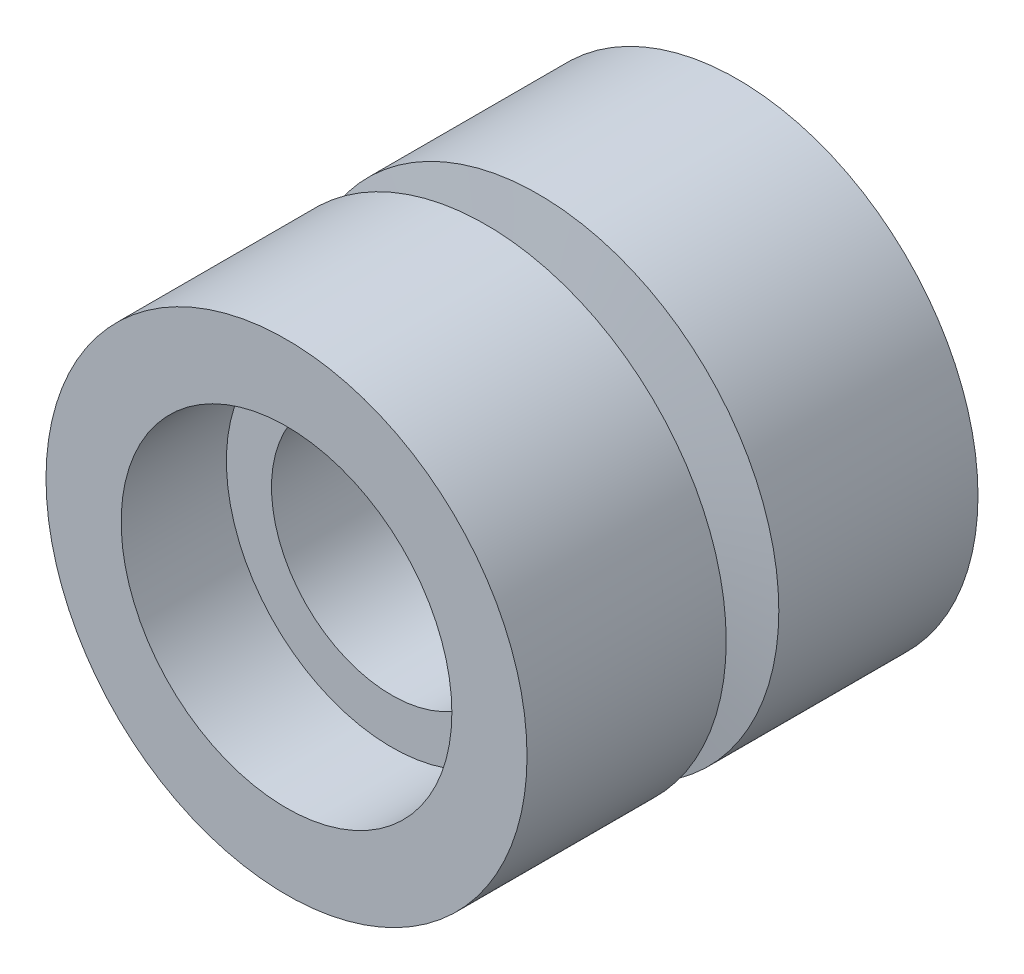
ISO-10303-21;
HEADER;
FILE_DESCRIPTION(('STEP AP214'),'2;1');
FILE_NAME('part.step','',(''),(''),'','','');
FILE_SCHEMA(('AUTOMOTIVE_DESIGN { 1 0 10303 214 1 1 1 1 }'));
ENDSEC;
DATA;
#1=APPLICATION_CONTEXT('core data for automotive mechanical design processes');
#2=APPLICATION_PROTOCOL_DEFINITION('international standard','automotive_design',2000,#1);
#3=PRODUCT_CONTEXT('',#1,'mechanical');
#4=PRODUCT('Part','Part','',(#3));
#5=PRODUCT_RELATED_PRODUCT_CATEGORY('part','',(#4));
#6=PRODUCT_DEFINITION_FORMATION('','',#4);
#7=PRODUCT_DEFINITION_CONTEXT('part definition',#1,'design');
#8=PRODUCT_DEFINITION('design','',#6,#7);
#9=PRODUCT_DEFINITION_SHAPE('','',#8);
#10=(LENGTH_UNIT() NAMED_UNIT(*) SI_UNIT(.MILLI.,.METRE.));
#11=(NAMED_UNIT(*) PLANE_ANGLE_UNIT() SI_UNIT($,.RADIAN.));
#12=(NAMED_UNIT(*) SI_UNIT($,.STERADIAN.) SOLID_ANGLE_UNIT());
#13=UNCERTAINTY_MEASURE_WITH_UNIT(LENGTH_MEASURE(1.E-05),#10,'distance_accuracy_value','');
#14=(GEOMETRIC_REPRESENTATION_CONTEXT(3) GLOBAL_UNCERTAINTY_ASSIGNED_CONTEXT((#13)) GLOBAL_UNIT_ASSIGNED_CONTEXT((#10,
#11,#12)) REPRESENTATION_CONTEXT('',''));
#15=CARTESIAN_POINT('',(0.,0.,0.));
#16=DIRECTION('',(0.,0.,1.));
#17=DIRECTION('',(1.,0.,0.));
#18=AXIS2_PLACEMENT_3D('',#15,#16,#17);
#19=CARTESIAN_POINT('',(0.,0.,21.700778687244));
#20=DIRECTION('',(0.,0.,1.));
#21=DIRECTION('',(1.,0.,0.));
#22=AXIS2_PLACEMENT_3D('',#19,#20,#21);
#23=CYLINDRICAL_SURFACE('',#22,11.);
#24=CARTESIAN_POINT('',(0.,0.,8.));
#25=DIRECTION('',(0.,0.,1.));
#26=DIRECTION('',(1.,0.,0.));
#27=AXIS2_PLACEMENT_3D('',#24,#25,#26);
#28=CIRCLE('',#27,11.);
#29=CARTESIAN_POINT('',(11.,0.,8.));
#30=VERTEX_POINT('',#29);
#31=EDGE_CURVE('E82',#30,#30,#28,.T.);
#32=ORIENTED_EDGE('',*,*,#31,.F.);
#33=EDGE_LOOP('',(#32));
#34=FACE_BOUND('',#33,.T.);
#35=CARTESIAN_POINT('',(0.,0.,15.));
#36=DIRECTION('',(0.,0.,1.));
#37=DIRECTION('',(1.,0.,0.));
#38=AXIS2_PLACEMENT_3D('',#35,#36,#37);
#39=CIRCLE('',#38,11.);
#40=CARTESIAN_POINT('',(11.,0.,15.));
#41=VERTEX_POINT('',#40);
#42=EDGE_CURVE('E12',#41,#41,#39,.T.);
#43=ORIENTED_EDGE('',*,*,#42,.T.);
#44=EDGE_LOOP('',(#43));
#45=FACE_BOUND('',#44,.T.);
#46=ADVANCED_FACE('F42',(#34,#45),#23,.F.);
#47=CARTESIAN_POINT('',(0.,11.,15.));
#48=DIRECTION('',(0.,0.,-1.));
#49=DIRECTION('',(-1.,0.,0.));
#50=AXIS2_PLACEMENT_3D('',#47,#48,#49);
#51=PLANE('',#50);
#52=ORIENTED_EDGE('',*,*,#42,.F.);
#53=EDGE_LOOP('',(#52));
#54=FACE_BOUND('',#53,.T.);
#55=CARTESIAN_POINT('',(0.,0.,15.));
#56=DIRECTION('',(0.,0.,1.));
#57=DIRECTION('',(1.,0.,0.));
#58=AXIS2_PLACEMENT_3D('',#55,#56,#57);
#59=CIRCLE('',#58,16.);
#60=CARTESIAN_POINT('',(16.,0.,15.));
#61=VERTEX_POINT('',#60);
#62=EDGE_CURVE('E48',#61,#61,#59,.T.);
#63=ORIENTED_EDGE('',*,*,#62,.T.);
#64=EDGE_LOOP('',(#63));
#65=FACE_BOUND('',#64,.T.);
#66=ADVANCED_FACE('F89',(#54,#65),#51,.F.);
#67=CARTESIAN_POINT('',(0.,0.,21.700778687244));
#68=DIRECTION('',(0.,0.,1.));
#69=DIRECTION('',(1.,0.,0.));
#70=AXIS2_PLACEMENT_3D('',#67,#68,#69);
#71=CYLINDRICAL_SURFACE('',#70,16.);
#72=ORIENTED_EDGE('',*,*,#62,.F.);
#73=EDGE_LOOP('',(#72));
#74=FACE_BOUND('',#73,.T.);
#75=CARTESIAN_POINT('',(0.,0.,1.75));
#76=DIRECTION('',(0.,0.,1.));
#77=DIRECTION('',(1.,0.,0.));
#78=AXIS2_PLACEMENT_3D('',#75,#76,#77);
#79=CIRCLE('',#78,16.);
#80=CARTESIAN_POINT('',(16.,0.,1.75));
#81=VERTEX_POINT('',#80);
#82=EDGE_CURVE('E52',#81,#81,#79,.T.);
#83=ORIENTED_EDGE('',*,*,#82,.T.);
#84=EDGE_LOOP('',(#83));
#85=FACE_BOUND('',#84,.T.);
#86=ADVANCED_FACE('F93',(#74,#85),#71,.T.);
#87=CARTESIAN_POINT('',(0.,0.,1.11756624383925));
#88=DIRECTION('',(0.,0.,1.));
#89=DIRECTION('',(1.,0.,0.));
#90=AXIS2_PLACEMENT_3D('',#87,#88,#89);
#91=CONICAL_SURFACE('',#90,11.5,1.43116998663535);
#92=ORIENTED_EDGE('',*,*,#82,.F.);
#93=EDGE_LOOP('',(#92));
#94=FACE_BOUND('',#93,.T.);
#95=CARTESIAN_POINT('',(0.,0.,1.11756624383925));
#96=DIRECTION('',(0.,0.,1.));
#97=DIRECTION('',(1.,0.,0.));
#98=AXIS2_PLACEMENT_3D('',#95,#96,#97);
#99=CIRCLE('',#98,11.5);
#100=CARTESIAN_POINT('',(11.5,0.,1.11756624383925));
#101=VERTEX_POINT('',#100);
#102=EDGE_CURVE('E56',#101,#101,#99,.T.);
#103=ORIENTED_EDGE('',*,*,#102,.T.);
#104=EDGE_LOOP('',(#103));
#105=FACE_BOUND('',#104,.T.);
#106=ADVANCED_FACE('F98',(#94,#105),#91,.T.);
#107=CARTESIAN_POINT('',(0.,0.,21.700778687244));
#108=DIRECTION('',(0.,0.,1.));
#109=DIRECTION('',(1.,0.,0.));
#110=AXIS2_PLACEMENT_3D('',#107,#108,#109);
#111=CYLINDRICAL_SURFACE('',#110,11.5);
#112=ORIENTED_EDGE('',*,*,#102,.F.);
#113=EDGE_LOOP('',(#112));
#114=FACE_BOUND('',#113,.T.);
#115=CARTESIAN_POINT('',(0.,0.,-1.11756624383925));
#116=DIRECTION('',(0.,0.,1.));
#117=DIRECTION('',(1.,0.,0.));
#118=AXIS2_PLACEMENT_3D('',#115,#116,#117);
#119=CIRCLE('',#118,11.5);
#120=CARTESIAN_POINT('',(11.5,0.,-1.11756624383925));
#121=VERTEX_POINT('',#120);
#122=EDGE_CURVE('E61',#121,#121,#119,.T.);
#123=ORIENTED_EDGE('',*,*,#122,.T.);
#124=EDGE_LOOP('',(#123));
#125=FACE_BOUND('',#124,.T.);
#126=ADVANCED_FACE('F104',(#114,#125),#111,.T.);
#127=CARTESIAN_POINT('',(0.,0.,-1.75));
#128=DIRECTION('',(0.,0.,-1.));
#129=DIRECTION('',(-1.,0.,0.));
#130=AXIS2_PLACEMENT_3D('',#127,#128,#129);
#131=CONICAL_SURFACE('',#130,16.,1.43116998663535);
#132=ORIENTED_EDGE('',*,*,#122,.F.);
#133=EDGE_LOOP('',(#132));
#134=FACE_BOUND('',#133,.T.);
#135=CARTESIAN_POINT('',(0.,0.,-1.75));
#136=DIRECTION('',(0.,0.,1.));
#137=DIRECTION('',(1.,0.,0.));
#138=AXIS2_PLACEMENT_3D('',#135,#136,#137);
#139=CIRCLE('',#138,16.);
#140=CARTESIAN_POINT('',(16.,0.,-1.75));
#141=VERTEX_POINT('',#140);
#142=EDGE_CURVE('E64',#141,#141,#139,.T.);
#143=ORIENTED_EDGE('',*,*,#142,.T.);
#144=EDGE_LOOP('',(#143));
#145=FACE_BOUND('',#144,.T.);
#146=ADVANCED_FACE('F108',(#134,#145),#131,.T.);
#147=CARTESIAN_POINT('',(0.,0.,21.700778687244));
#148=DIRECTION('',(0.,0.,1.));
#149=DIRECTION('',(1.,0.,0.));
#150=AXIS2_PLACEMENT_3D('',#147,#148,#149);
#151=CYLINDRICAL_SURFACE('',#150,16.);
#152=ORIENTED_EDGE('',*,*,#142,.F.);
#153=EDGE_LOOP('',(#152));
#154=FACE_BOUND('',#153,.T.);
#155=CARTESIAN_POINT('',(0.,0.,-15.));
#156=DIRECTION('',(0.,0.,1.));
#157=DIRECTION('',(1.,0.,0.));
#158=AXIS2_PLACEMENT_3D('',#155,#156,#157);
#159=CIRCLE('',#158,16.);
#160=CARTESIAN_POINT('',(16.,0.,-15.));
#161=VERTEX_POINT('',#160);
#162=EDGE_CURVE('E67',#161,#161,#159,.T.);
#163=ORIENTED_EDGE('',*,*,#162,.T.);
#164=EDGE_LOOP('',(#163));
#165=FACE_BOUND('',#164,.T.);
#166=ADVANCED_FACE('F112',(#154,#165),#151,.T.);
#167=CARTESIAN_POINT('',(0.,16.,-15.));
#168=DIRECTION('',(0.,0.,1.));
#169=DIRECTION('',(1.,0.,0.));
#170=AXIS2_PLACEMENT_3D('',#167,#168,#169);
#171=PLANE('',#170);
#172=ORIENTED_EDGE('',*,*,#162,.F.);
#173=EDGE_LOOP('',(#172));
#174=FACE_BOUND('',#173,.T.);
#175=CARTESIAN_POINT('',(0.,0.,-15.));
#176=DIRECTION('',(0.,0.,1.));
#177=DIRECTION('',(1.,0.,0.));
#178=AXIS2_PLACEMENT_3D('',#175,#176,#177);
#179=CIRCLE('',#178,11.);
#180=CARTESIAN_POINT('',(11.,0.,-15.));
#181=VERTEX_POINT('',#180);
#182=EDGE_CURVE('E70',#181,#181,#179,.T.);
#183=ORIENTED_EDGE('',*,*,#182,.T.);
#184=EDGE_LOOP('',(#183));
#185=FACE_BOUND('',#184,.T.);
#186=ADVANCED_FACE('F116',(#174,#185),#171,.F.);
#187=CARTESIAN_POINT('',(0.,0.,21.700778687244));
#188=DIRECTION('',(0.,0.,1.));
#189=DIRECTION('',(1.,0.,0.));
#190=AXIS2_PLACEMENT_3D('',#187,#188,#189);
#191=CYLINDRICAL_SURFACE('',#190,11.);
#192=ORIENTED_EDGE('',*,*,#182,.F.);
#193=EDGE_LOOP('',(#192));
#194=FACE_BOUND('',#193,.T.);
#195=CARTESIAN_POINT('',(0.,0.,-8.));
#196=DIRECTION('',(0.,0.,1.));
#197=DIRECTION('',(1.,0.,0.));
#198=AXIS2_PLACEMENT_3D('',#195,#196,#197);
#199=CIRCLE('',#198,11.);
#200=CARTESIAN_POINT('',(11.,0.,-8.));
#201=VERTEX_POINT('',#200);
#202=EDGE_CURVE('E73',#201,#201,#199,.T.);
#203=ORIENTED_EDGE('',*,*,#202,.T.);
#204=EDGE_LOOP('',(#203));
#205=FACE_BOUND('',#204,.T.);
#206=ADVANCED_FACE('F120',(#194,#205),#191,.F.);
#207=CARTESIAN_POINT('',(0.,11.,-8.));
#208=DIRECTION('',(0.,0.,1.));
#209=DIRECTION('',(1.,0.,0.));
#210=AXIS2_PLACEMENT_3D('',#207,#208,#209);
#211=PLANE('',#210);
#212=ORIENTED_EDGE('',*,*,#202,.F.);
#213=EDGE_LOOP('',(#212));
#214=FACE_BOUND('',#213,.T.);
#215=CARTESIAN_POINT('',(0.,0.,-8.));
#216=DIRECTION('',(0.,0.,1.));
#217=DIRECTION('',(1.,0.,0.));
#218=AXIS2_PLACEMENT_3D('',#215,#216,#217);
#219=CIRCLE('',#218,8.);
#220=CARTESIAN_POINT('',(8.,0.,-8.));
#221=VERTEX_POINT('',#220);
#222=EDGE_CURVE('E76',#221,#221,#219,.T.);
#223=ORIENTED_EDGE('',*,*,#222,.T.);
#224=EDGE_LOOP('',(#223));
#225=FACE_BOUND('',#224,.T.);
#226=ADVANCED_FACE('F124',(#214,#225),#211,.F.);
#227=CARTESIAN_POINT('',(0.,0.,21.700778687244));
#228=DIRECTION('',(0.,0.,1.));
#229=DIRECTION('',(1.,0.,0.));
#230=AXIS2_PLACEMENT_3D('',#227,#228,#229);
#231=CYLINDRICAL_SURFACE('',#230,8.);
#232=ORIENTED_EDGE('',*,*,#222,.F.);
#233=EDGE_LOOP('',(#232));
#234=FACE_BOUND('',#233,.T.);
#235=CARTESIAN_POINT('',(0.,0.,8.));
#236=DIRECTION('',(0.,0.,1.));
#237=DIRECTION('',(1.,0.,0.));
#238=AXIS2_PLACEMENT_3D('',#235,#236,#237);
#239=CIRCLE('',#238,8.);
#240=CARTESIAN_POINT('',(8.,0.,8.));
#241=VERTEX_POINT('',#240);
#242=EDGE_CURVE('E79',#241,#241,#239,.T.);
#243=ORIENTED_EDGE('',*,*,#242,.T.);
#244=EDGE_LOOP('',(#243));
#245=FACE_BOUND('',#244,.T.);
#246=ADVANCED_FACE('F128',(#234,#245),#231,.F.);
#247=CARTESIAN_POINT('',(0.,8.,8.));
#248=DIRECTION('',(0.,0.,-1.));
#249=DIRECTION('',(-1.,0.,0.));
#250=AXIS2_PLACEMENT_3D('',#247,#248,#249);
#251=PLANE('',#250);
#252=ORIENTED_EDGE('',*,*,#242,.F.);
#253=EDGE_LOOP('',(#252));
#254=FACE_BOUND('',#253,.T.);
#255=ORIENTED_EDGE('',*,*,#31,.T.);
#256=EDGE_LOOP('',(#255));
#257=FACE_BOUND('',#256,.T.);
#258=ADVANCED_FACE('F86',(#254,#257),#251,.F.);
#259=CLOSED_SHELL('',(#46,#66,#86,#106,#126,#146,#166,#186,#206,#226,#246,#258));
#260=MANIFOLD_SOLID_BREP('B2',#259);
#261=ADVANCED_BREP_SHAPE_REPRESENTATION('',(#18,#260),#14);
#262=SHAPE_DEFINITION_REPRESENTATION(#9,#261);
ENDSEC;
END-ISO-10303-21;
